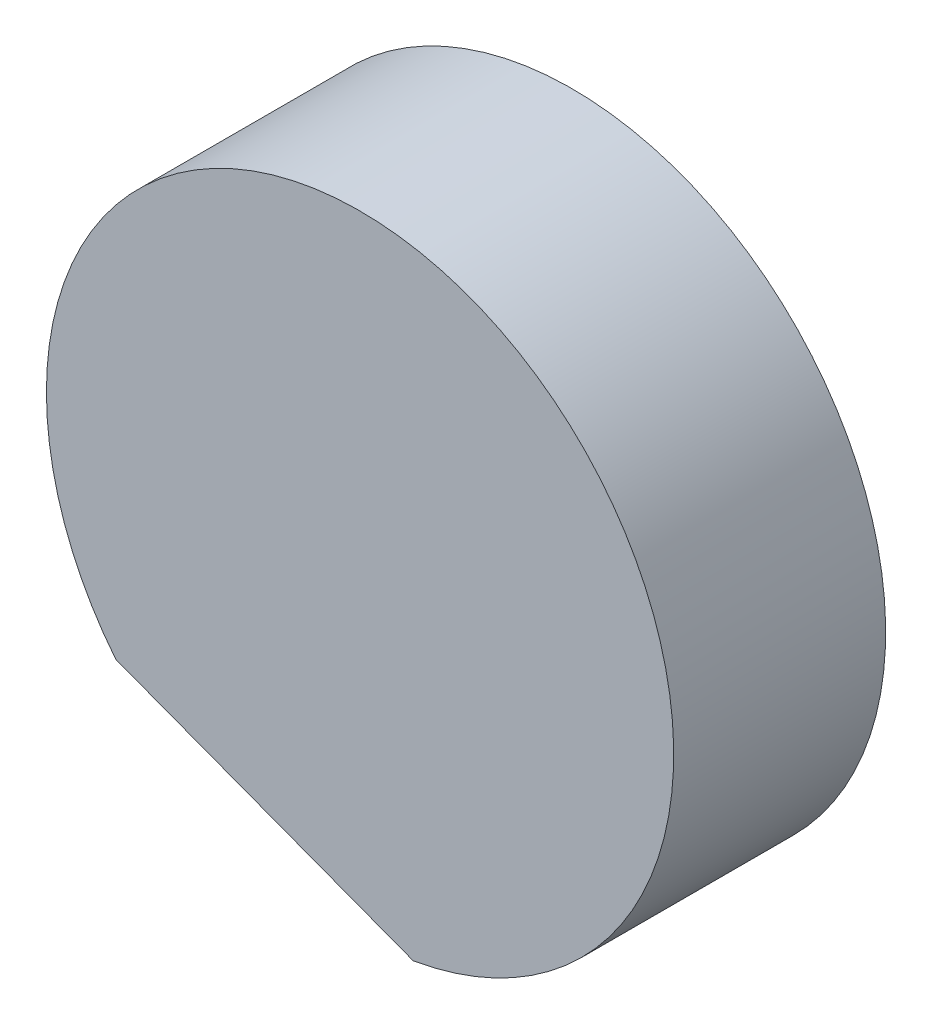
from build123d import *

# Parameters (mm, degrees)
EXTRUDE1_DEPTH = 25.4


with BuildPart() as part:
    # Sketch1 → Extrude1 (new body)
    with BuildSketch(Plane.XY):
        with BuildLine():
            ThreePointArc((37.586445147, 0), (-12.502053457, 35.446290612), (-29.269545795, -23.580384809))
            Line((-29.269545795, -23.580384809), (6.372970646, -37.042220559))
            ThreePointArc((6.372970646, -37.042220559), (28.742635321, -24.219863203), (37.586445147, 0))
        make_face()
    extrude(amount=EXTRUDE1_DEPTH)


solid = part.part
